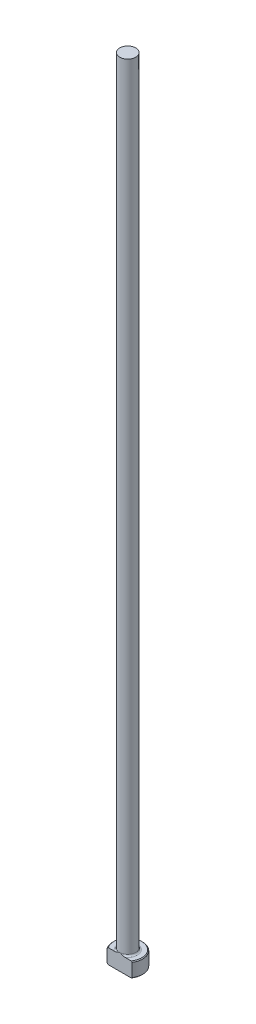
from build123d import *

# Parameters (mm, degrees)
CHAMFER1_SIZE = 0.254
FILLET1_R     = 0.508
KEY_DEPTH     = 255.089281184


with BuildPart() as part:
    # Sketch1 → Revolve1 (revolve)
    with BuildSketch(Plane.XY, mode=Mode.PRIVATE) as revolve1_sk:
        Polygon((0, 0), (-4.7625, 0), (-4.7625, 4.7498), (-2.57937, 4.7498), (-2.57937, 254), (0, 254), align=None)
    revolve(revolve1_sk.sketch.rotate(Axis((0, 259.958771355, 0), (0, -1, 0)), 270), axis=Axis((0, 259.958771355, 0), (0, -1, 0)))

    # Chamfer1
    chamfer1_edges = [part.edges().sort_by_distance(p)[0] for p in [
        (0, 4.7498, -4.7625),
        (0, 0, -4.7625),
    ]]
    chamfer(chamfer1_edges, length=CHAMFER1_SIZE)

    # Fillet1
    fillet1_edges = [part.edges().sort_by_distance(p)[0] for p in [
        (0, 4.7498, -2.57937),
    ]]
    fillet(fillet1_edges, radius=FILLET1_R)

    # Sketch2 → Key (cut, through all)
    with BuildSketch(Plane(origin=(0, 0, 0), x_dir=(1, 0, 0), z_dir=(0, 1, 0))):
        with BuildLine():
            Line((-4.003530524, -2.57937), (4.003530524, -2.57937))
            ThreePointArc((4.003530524, -2.57937), (0, -4.7625), (-4.003530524, -2.57937))
        make_face()
    extrude(amount=KEY_DEPTH, mode=Mode.SUBTRACT)


solid = part.part
